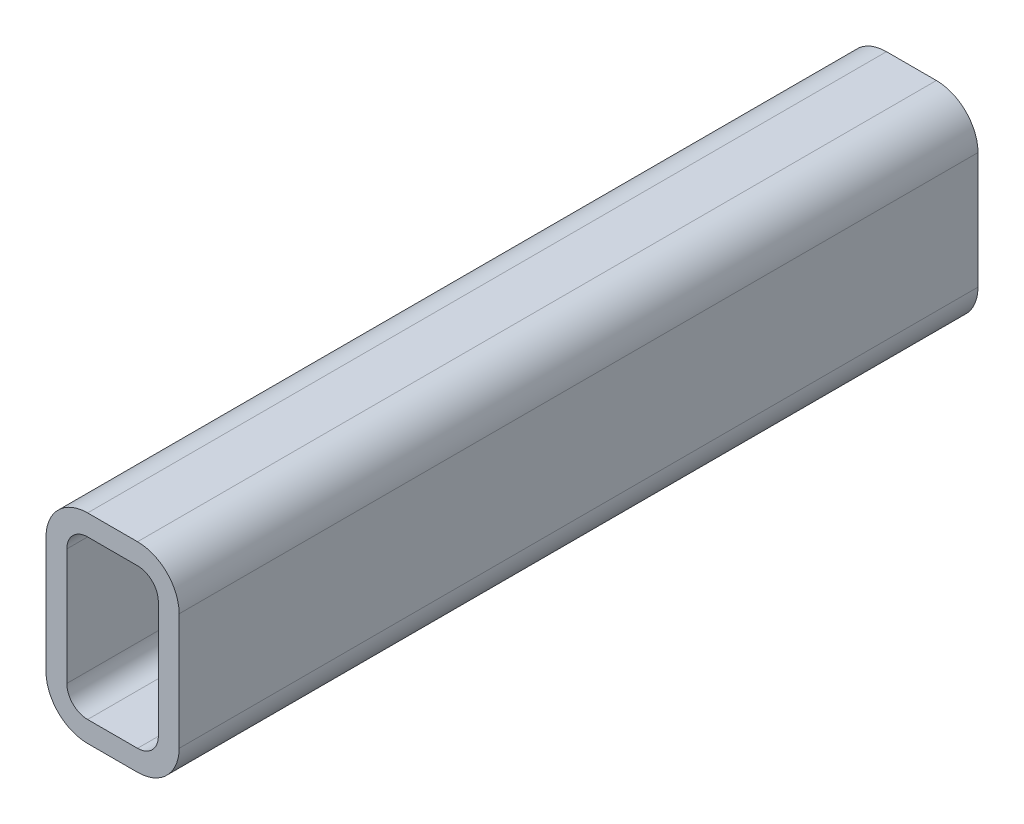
ISO-10303-21;
HEADER;
FILE_DESCRIPTION(('STEP AP214'),'2;1');
FILE_NAME('part.step','',(''),(''),'','','');
FILE_SCHEMA(('AUTOMOTIVE_DESIGN { 1 0 10303 214 1 1 1 1 }'));
ENDSEC;
DATA;
#1=APPLICATION_CONTEXT('core data for automotive mechanical design processes');
#2=APPLICATION_PROTOCOL_DEFINITION('international standard','automotive_design',2000,#1);
#3=PRODUCT_CONTEXT('',#1,'mechanical');
#4=PRODUCT('Part','Part','',(#3));
#5=PRODUCT_RELATED_PRODUCT_CATEGORY('part','',(#4));
#6=PRODUCT_DEFINITION_FORMATION('','',#4);
#7=PRODUCT_DEFINITION_CONTEXT('part definition',#1,'design');
#8=PRODUCT_DEFINITION('design','',#6,#7);
#9=PRODUCT_DEFINITION_SHAPE('','',#8);
#10=(LENGTH_UNIT() NAMED_UNIT(*) SI_UNIT(.MILLI.,.METRE.));
#11=(NAMED_UNIT(*) PLANE_ANGLE_UNIT() SI_UNIT($,.RADIAN.));
#12=(NAMED_UNIT(*) SI_UNIT($,.STERADIAN.) SOLID_ANGLE_UNIT());
#13=UNCERTAINTY_MEASURE_WITH_UNIT(LENGTH_MEASURE(1.E-05),#10,'distance_accuracy_value','');
#14=(GEOMETRIC_REPRESENTATION_CONTEXT(3) GLOBAL_UNCERTAINTY_ASSIGNED_CONTEXT((#13)) GLOBAL_UNIT_ASSIGNED_CONTEXT((#10,
#11,#12)) REPRESENTATION_CONTEXT('',''));
#15=CARTESIAN_POINT('',(0.,0.,0.));
#16=DIRECTION('',(0.,0.,1.));
#17=DIRECTION('',(1.,0.,0.));
#18=AXIS2_PLACEMENT_3D('',#15,#16,#17);
#19=CARTESIAN_POINT('',(15.875,60.325,304.8));
#20=DIRECTION('',(0.,0.,1.));
#21=DIRECTION('',(1.,0.,0.));
#22=AXIS2_PLACEMENT_3D('',#19,#20,#21);
#23=PLANE('',#22);
#24=CARTESIAN_POINT('',(15.875,60.325,304.8));
#25=DIRECTION('',(0.,0.,1.));
#26=DIRECTION('',(1.,0.,0.));
#27=AXIS2_PLACEMENT_3D('',#24,#25,#26);
#28=CIRCLE('',#27,15.875);
#29=CARTESIAN_POINT('',(15.875,76.2,304.8));
#30=VERTEX_POINT('',#29);
#31=CARTESIAN_POINT('',(0.,60.325,304.8));
#32=VERTEX_POINT('',#31);
#33=EDGE_CURVE('E211',#30,#32,#28,.T.);
#34=ORIENTED_EDGE('',*,*,#33,.T.);
#35=DIRECTION('',(0.,-1.,0.));
#36=VECTOR('',#35,1.);
#37=CARTESIAN_POINT('',(0.,15.875,304.8));
#38=LINE('',#37,#36);
#39=CARTESIAN_POINT('',(0.,15.875,304.8));
#40=VERTEX_POINT('',#39);
#41=EDGE_CURVE('E214',#32,#40,#38,.T.);
#42=ORIENTED_EDGE('',*,*,#41,.T.);
#43=CARTESIAN_POINT('',(15.875,15.875,304.8));
#44=DIRECTION('',(0.,0.,1.));
#45=DIRECTION('',(1.,0.,0.));
#46=AXIS2_PLACEMENT_3D('',#43,#44,#45);
#47=CIRCLE('',#46,15.875);
#48=CARTESIAN_POINT('',(15.875,0.,304.8));
#49=VERTEX_POINT('',#48);
#50=EDGE_CURVE('E217',#40,#49,#47,.T.);
#51=ORIENTED_EDGE('',*,*,#50,.T.);
#52=DIRECTION('',(1.,0.,0.));
#53=VECTOR('',#52,1.);
#54=CARTESIAN_POINT('',(34.925,0.,304.8));
#55=LINE('',#54,#53);
#56=CARTESIAN_POINT('',(34.925,0.,304.8));
#57=VERTEX_POINT('',#56);
#58=EDGE_CURVE('E219',#49,#57,#55,.T.);
#59=ORIENTED_EDGE('',*,*,#58,.T.);
#60=CARTESIAN_POINT('',(34.925,15.875,304.8));
#61=DIRECTION('',(0.,0.,1.));
#62=DIRECTION('',(1.,0.,0.));
#63=AXIS2_PLACEMENT_3D('',#60,#61,#62);
#64=CIRCLE('',#63,15.875);
#65=CARTESIAN_POINT('',(50.8,15.875,304.8));
#66=VERTEX_POINT('',#65);
#67=EDGE_CURVE('E221',#57,#66,#64,.T.);
#68=ORIENTED_EDGE('',*,*,#67,.T.);
#69=DIRECTION('',(0.,1.,0.));
#70=VECTOR('',#69,1.);
#71=CARTESIAN_POINT('',(50.8,60.325,304.8));
#72=LINE('',#71,#70);
#73=CARTESIAN_POINT('',(50.8,60.325,304.8));
#74=VERTEX_POINT('',#73);
#75=EDGE_CURVE('E223',#66,#74,#72,.T.);
#76=ORIENTED_EDGE('',*,*,#75,.T.);
#77=CARTESIAN_POINT('',(34.925,60.325,304.8));
#78=DIRECTION('',(0.,0.,1.));
#79=DIRECTION('',(1.,0.,0.));
#80=AXIS2_PLACEMENT_3D('',#77,#78,#79);
#81=CIRCLE('',#80,15.875);
#82=CARTESIAN_POINT('',(34.925,76.2,304.8));
#83=VERTEX_POINT('',#82);
#84=EDGE_CURVE('E225',#74,#83,#81,.T.);
#85=ORIENTED_EDGE('',*,*,#84,.T.);
#86=DIRECTION('',(-1.,0.,0.));
#87=VECTOR('',#86,1.);
#88=CARTESIAN_POINT('',(15.875,76.2,304.8));
#89=LINE('',#88,#87);
#90=EDGE_CURVE('E227',#83,#30,#89,.T.);
#91=ORIENTED_EDGE('',*,*,#90,.T.);
#92=EDGE_LOOP('',(#34,#42,#51,#59,#68,#76,#85,#91));
#93=FACE_BOUND('',#92,.T.);
#94=DIRECTION('',(0.,-1.,0.));
#95=VECTOR('',#94,1.);
#96=CARTESIAN_POINT('',(7.9375,15.875,304.8));
#97=LINE('',#96,#95);
#98=CARTESIAN_POINT('',(7.9375,60.325,304.8));
#99=VERTEX_POINT('',#98);
#100=CARTESIAN_POINT('',(7.9375,15.875,304.8));
#101=VERTEX_POINT('',#100);
#102=EDGE_CURVE('E154',#99,#101,#97,.T.);
#103=ORIENTED_EDGE('',*,*,#102,.F.);
#104=CARTESIAN_POINT('',(15.875,60.325,304.8));
#105=DIRECTION('',(0.,0.,1.));
#106=DIRECTION('',(1.,0.,0.));
#107=AXIS2_PLACEMENT_3D('',#104,#105,#106);
#108=CIRCLE('',#107,7.93750000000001);
#109=CARTESIAN_POINT('',(15.875,68.2625,304.8));
#110=VERTEX_POINT('',#109);
#111=EDGE_CURVE('E146',#110,#99,#108,.T.);
#112=ORIENTED_EDGE('',*,*,#111,.F.);
#113=DIRECTION('',(-1.,0.,0.));
#114=VECTOR('',#113,1.);
#115=CARTESIAN_POINT('',(15.875,68.2625,304.8));
#116=LINE('',#115,#114);
#117=CARTESIAN_POINT('',(34.925,68.2625,304.8));
#118=VERTEX_POINT('',#117);
#119=EDGE_CURVE('E179',#118,#110,#116,.T.);
#120=ORIENTED_EDGE('',*,*,#119,.F.);
#121=CARTESIAN_POINT('',(34.925,60.325,304.8));
#122=DIRECTION('',(0.,0.,1.));
#123=DIRECTION('',(1.,0.,0.));
#124=AXIS2_PLACEMENT_3D('',#121,#122,#123);
#125=CIRCLE('',#124,7.93750000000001);
#126=CARTESIAN_POINT('',(42.8625,60.325,304.8));
#127=VERTEX_POINT('',#126);
#128=EDGE_CURVE('E177',#127,#118,#125,.T.);
#129=ORIENTED_EDGE('',*,*,#128,.F.);
#130=DIRECTION('',(0.,1.,0.));
#131=VECTOR('',#130,1.);
#132=CARTESIAN_POINT('',(42.8625,60.325,304.8));
#133=LINE('',#132,#131);
#134=CARTESIAN_POINT('',(42.8625,15.875,304.8));
#135=VERTEX_POINT('',#134);
#136=EDGE_CURVE('E175',#135,#127,#133,.T.);
#137=ORIENTED_EDGE('',*,*,#136,.F.);
#138=CARTESIAN_POINT('',(34.925,15.875,304.8));
#139=DIRECTION('',(0.,0.,1.));
#140=DIRECTION('',(1.,0.,0.));
#141=AXIS2_PLACEMENT_3D('',#138,#139,#140);
#142=CIRCLE('',#141,7.9375);
#143=CARTESIAN_POINT('',(34.925,7.93750000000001,304.8));
#144=VERTEX_POINT('',#143);
#145=EDGE_CURVE('E173',#144,#135,#142,.T.);
#146=ORIENTED_EDGE('',*,*,#145,.F.);
#147=DIRECTION('',(1.,0.,0.));
#148=VECTOR('',#147,1.);
#149=CARTESIAN_POINT('',(34.925,7.93750000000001,304.8));
#150=LINE('',#149,#148);
#151=CARTESIAN_POINT('',(15.875,7.93750000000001,304.8));
#152=VERTEX_POINT('',#151);
#153=EDGE_CURVE('E169',#152,#144,#150,.T.);
#154=ORIENTED_EDGE('',*,*,#153,.F.);
#155=CARTESIAN_POINT('',(15.875,15.875,304.8));
#156=DIRECTION('',(0.,0.,1.));
#157=DIRECTION('',(1.,0.,0.));
#158=AXIS2_PLACEMENT_3D('',#155,#156,#157);
#159=CIRCLE('',#158,7.9375);
#160=EDGE_CURVE('E167',#101,#152,#159,.T.);
#161=ORIENTED_EDGE('',*,*,#160,.F.);
#162=EDGE_LOOP('',(#103,#112,#120,#129,#137,#146,#154,#161));
#163=FACE_BOUND('',#162,.T.);
#164=ADVANCED_FACE('F33',(#93,#163),#23,.T.);
#165=CARTESIAN_POINT('',(15.875,60.325,0.));
#166=DIRECTION('',(0.,0.,1.));
#167=DIRECTION('',(1.,0.,0.));
#168=AXIS2_PLACEMENT_3D('',#165,#166,#167);
#169=PLANE('',#168);
#170=CARTESIAN_POINT('',(15.875,60.325,0.));
#171=DIRECTION('',(0.,0.,1.));
#172=DIRECTION('',(1.,0.,0.));
#173=AXIS2_PLACEMENT_3D('',#170,#171,#172);
#174=CIRCLE('',#173,15.875);
#175=CARTESIAN_POINT('',(15.875,76.2,0.));
#176=VERTEX_POINT('',#175);
#177=CARTESIAN_POINT('',(0.,60.325,0.));
#178=VERTEX_POINT('',#177);
#179=EDGE_CURVE('E162',#176,#178,#174,.T.);
#180=ORIENTED_EDGE('',*,*,#179,.F.);
#181=DIRECTION('',(-1.,0.,0.));
#182=VECTOR('',#181,1.);
#183=CARTESIAN_POINT('',(15.875,76.2,0.));
#184=LINE('',#183,#182);
#185=CARTESIAN_POINT('',(34.925,76.2,0.));
#186=VERTEX_POINT('',#185);
#187=EDGE_CURVE('E215',#186,#176,#184,.T.);
#188=ORIENTED_EDGE('',*,*,#187,.F.);
#189=CARTESIAN_POINT('',(34.925,60.325,0.));
#190=DIRECTION('',(0.,0.,1.));
#191=DIRECTION('',(1.,0.,0.));
#192=AXIS2_PLACEMENT_3D('',#189,#190,#191);
#193=CIRCLE('',#192,15.875);
#194=CARTESIAN_POINT('',(50.8,60.325,0.));
#195=VERTEX_POINT('',#194);
#196=EDGE_CURVE('E242',#195,#186,#193,.T.);
#197=ORIENTED_EDGE('',*,*,#196,.F.);
#198=DIRECTION('',(0.,1.,0.));
#199=VECTOR('',#198,1.);
#200=CARTESIAN_POINT('',(50.8,60.325,0.));
#201=LINE('',#200,#199);
#202=CARTESIAN_POINT('',(50.8,15.875,0.));
#203=VERTEX_POINT('',#202);
#204=EDGE_CURVE('E240',#203,#195,#201,.T.);
#205=ORIENTED_EDGE('',*,*,#204,.F.);
#206=CARTESIAN_POINT('',(34.925,15.875,0.));
#207=DIRECTION('',(0.,0.,1.));
#208=DIRECTION('',(1.,0.,0.));
#209=AXIS2_PLACEMENT_3D('',#206,#207,#208);
#210=CIRCLE('',#209,15.875);
#211=CARTESIAN_POINT('',(34.925,0.,0.));
#212=VERTEX_POINT('',#211);
#213=EDGE_CURVE('E238',#212,#203,#210,.T.);
#214=ORIENTED_EDGE('',*,*,#213,.F.);
#215=DIRECTION('',(1.,0.,0.));
#216=VECTOR('',#215,1.);
#217=CARTESIAN_POINT('',(34.925,0.,0.));
#218=LINE('',#217,#216);
#219=CARTESIAN_POINT('',(15.875,0.,0.));
#220=VERTEX_POINT('',#219);
#221=EDGE_CURVE('E236',#220,#212,#218,.T.);
#222=ORIENTED_EDGE('',*,*,#221,.F.);
#223=CARTESIAN_POINT('',(15.875,15.875,0.));
#224=DIRECTION('',(0.,0.,1.));
#225=DIRECTION('',(1.,0.,0.));
#226=AXIS2_PLACEMENT_3D('',#223,#224,#225);
#227=CIRCLE('',#226,15.875);
#228=CARTESIAN_POINT('',(0.,15.875,0.));
#229=VERTEX_POINT('',#228);
#230=EDGE_CURVE('E234',#229,#220,#227,.T.);
#231=ORIENTED_EDGE('',*,*,#230,.F.);
#232=DIRECTION('',(0.,-1.,0.));
#233=VECTOR('',#232,1.);
#234=CARTESIAN_POINT('',(0.,15.875,0.));
#235=LINE('',#234,#233);
#236=EDGE_CURVE('E232',#178,#229,#235,.T.);
#237=ORIENTED_EDGE('',*,*,#236,.F.);
#238=EDGE_LOOP('',(#180,#188,#197,#205,#214,#222,#231,#237));
#239=FACE_BOUND('',#238,.T.);
#240=CARTESIAN_POINT('',(15.875,60.325,0.));
#241=DIRECTION('',(0.,0.,1.));
#242=DIRECTION('',(1.,0.,0.));
#243=AXIS2_PLACEMENT_3D('',#240,#241,#242);
#244=CIRCLE('',#243,7.93750000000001);
#245=CARTESIAN_POINT('',(15.875,68.2625,0.));
#246=VERTEX_POINT('',#245);
#247=CARTESIAN_POINT('',(7.9375,60.325,0.));
#248=VERTEX_POINT('',#247);
#249=EDGE_CURVE('E56',#246,#248,#244,.T.);
#250=ORIENTED_EDGE('',*,*,#249,.T.);
#251=DIRECTION('',(0.,-1.,0.));
#252=VECTOR('',#251,1.);
#253=CARTESIAN_POINT('',(7.9375,15.875,0.));
#254=LINE('',#253,#252);
#255=CARTESIAN_POINT('',(7.9375,15.875,0.));
#256=VERTEX_POINT('',#255);
#257=EDGE_CURVE('E161',#248,#256,#254,.T.);
#258=ORIENTED_EDGE('',*,*,#257,.T.);
#259=CARTESIAN_POINT('',(15.875,15.875,0.));
#260=DIRECTION('',(0.,0.,1.));
#261=DIRECTION('',(1.,0.,0.));
#262=AXIS2_PLACEMENT_3D('',#259,#260,#261);
#263=CIRCLE('',#262,7.9375);
#264=CARTESIAN_POINT('',(15.875,7.93750000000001,0.));
#265=VERTEX_POINT('',#264);
#266=EDGE_CURVE('E183',#256,#265,#263,.T.);
#267=ORIENTED_EDGE('',*,*,#266,.T.);
#268=DIRECTION('',(1.,0.,0.));
#269=VECTOR('',#268,1.);
#270=CARTESIAN_POINT('',(34.925,7.93750000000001,0.));
#271=LINE('',#270,#269);
#272=CARTESIAN_POINT('',(34.925,7.93750000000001,0.));
#273=VERTEX_POINT('',#272);
#274=EDGE_CURVE('E186',#265,#273,#271,.T.);
#275=ORIENTED_EDGE('',*,*,#274,.T.);
#276=CARTESIAN_POINT('',(34.925,15.875,0.));
#277=DIRECTION('',(0.,0.,1.));
#278=DIRECTION('',(1.,0.,0.));
#279=AXIS2_PLACEMENT_3D('',#276,#277,#278);
#280=CIRCLE('',#279,7.9375);
#281=CARTESIAN_POINT('',(42.8625,15.875,0.));
#282=VERTEX_POINT('',#281);
#283=EDGE_CURVE('E189',#273,#282,#280,.T.);
#284=ORIENTED_EDGE('',*,*,#283,.T.);
#285=DIRECTION('',(0.,1.,0.));
#286=VECTOR('',#285,1.);
#287=CARTESIAN_POINT('',(42.8625,60.325,0.));
#288=LINE('',#287,#286);
#289=CARTESIAN_POINT('',(42.8625,60.325,0.));
#290=VERTEX_POINT('',#289);
#291=EDGE_CURVE('E192',#282,#290,#288,.T.);
#292=ORIENTED_EDGE('',*,*,#291,.T.);
#293=CARTESIAN_POINT('',(34.925,60.325,0.));
#294=DIRECTION('',(0.,0.,1.));
#295=DIRECTION('',(1.,0.,0.));
#296=AXIS2_PLACEMENT_3D('',#293,#294,#295);
#297=CIRCLE('',#296,7.93750000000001);
#298=CARTESIAN_POINT('',(34.925,68.2625,0.));
#299=VERTEX_POINT('',#298);
#300=EDGE_CURVE('E195',#290,#299,#297,.T.);
#301=ORIENTED_EDGE('',*,*,#300,.T.);
#302=DIRECTION('',(-1.,0.,0.));
#303=VECTOR('',#302,1.);
#304=CARTESIAN_POINT('',(15.875,68.2625,0.));
#305=LINE('',#304,#303);
#306=EDGE_CURVE('E155',#299,#246,#305,.T.);
#307=ORIENTED_EDGE('',*,*,#306,.T.);
#308=EDGE_LOOP('',(#250,#258,#267,#275,#284,#292,#301,#307));
#309=FACE_BOUND('',#308,.T.);
#310=ADVANCED_FACE('F272',(#239,#309),#169,.F.);
#311=CARTESIAN_POINT('',(15.875,60.325,304.8));
#312=DIRECTION('',(0.,0.,-1.));
#313=DIRECTION('',(-1.,0.,0.));
#314=AXIS2_PLACEMENT_3D('',#311,#312,#313);
#315=CYLINDRICAL_SURFACE('',#314,15.875);
#316=ORIENTED_EDGE('',*,*,#179,.T.);
#317=DIRECTION('',(0.,0.,-1.));
#318=VECTOR('',#317,1.);
#319=CARTESIAN_POINT('',(0.,60.325,304.8));
#320=LINE('',#319,#318);
#321=EDGE_CURVE('E11',#32,#178,#320,.T.);
#322=ORIENTED_EDGE('',*,*,#321,.F.);
#323=ORIENTED_EDGE('',*,*,#33,.F.);
#324=DIRECTION('',(0.,0.,-1.));
#325=VECTOR('',#324,1.);
#326=CARTESIAN_POINT('',(15.875,76.2,304.8));
#327=LINE('',#326,#325);
#328=EDGE_CURVE('E229',#30,#176,#327,.T.);
#329=ORIENTED_EDGE('',*,*,#328,.T.);
#330=EDGE_LOOP('',(#316,#322,#323,#329));
#331=FACE_BOUND('',#330,.T.);
#332=ADVANCED_FACE('F35',(#331),#315,.T.);
#333=CARTESIAN_POINT('',(0.,15.875,304.8));
#334=DIRECTION('',(1.,0.,0.));
#335=DIRECTION('',(0.,0.,-1.));
#336=AXIS2_PLACEMENT_3D('',#333,#334,#335);
#337=PLANE('',#336);
#338=ORIENTED_EDGE('',*,*,#236,.T.);
#339=DIRECTION('',(0.,0.,-1.));
#340=VECTOR('',#339,1.);
#341=CARTESIAN_POINT('',(0.,15.875,304.8));
#342=LINE('',#341,#340);
#343=EDGE_CURVE('E41',#40,#229,#342,.T.);
#344=ORIENTED_EDGE('',*,*,#343,.F.);
#345=ORIENTED_EDGE('',*,*,#41,.F.);
#346=ORIENTED_EDGE('',*,*,#321,.T.);
#347=EDGE_LOOP('',(#338,#344,#345,#346));
#348=FACE_BOUND('',#347,.T.);
#349=ADVANCED_FACE('F289',(#348),#337,.F.);
#350=CARTESIAN_POINT('',(15.875,15.875,304.8));
#351=DIRECTION('',(0.,0.,-1.));
#352=DIRECTION('',(-1.,0.,0.));
#353=AXIS2_PLACEMENT_3D('',#350,#351,#352);
#354=CYLINDRICAL_SURFACE('',#353,15.875);
#355=ORIENTED_EDGE('',*,*,#230,.T.);
#356=DIRECTION('',(0.,0.,-1.));
#357=VECTOR('',#356,1.);
#358=CARTESIAN_POINT('',(15.875,0.,304.8));
#359=LINE('',#358,#357);
#360=EDGE_CURVE('E259',#49,#220,#359,.T.);
#361=ORIENTED_EDGE('',*,*,#360,.F.);
#362=ORIENTED_EDGE('',*,*,#50,.F.);
#363=ORIENTED_EDGE('',*,*,#343,.T.);
#364=EDGE_LOOP('',(#355,#361,#362,#363));
#365=FACE_BOUND('',#364,.T.);
#366=ADVANCED_FACE('F266',(#365),#354,.T.);
#367=CARTESIAN_POINT('',(34.925,0.,304.8));
#368=DIRECTION('',(0.,1.,0.));
#369=DIRECTION('',(0.,0.,1.));
#370=AXIS2_PLACEMENT_3D('',#367,#368,#369);
#371=PLANE('',#370);
#372=ORIENTED_EDGE('',*,*,#221,.T.);
#373=DIRECTION('',(0.,0.,-1.));
#374=VECTOR('',#373,1.);
#375=CARTESIAN_POINT('',(34.925,0.,304.8));
#376=LINE('',#375,#374);
#377=EDGE_CURVE('E256',#57,#212,#376,.T.);
#378=ORIENTED_EDGE('',*,*,#377,.F.);
#379=ORIENTED_EDGE('',*,*,#58,.F.);
#380=ORIENTED_EDGE('',*,*,#360,.T.);
#381=EDGE_LOOP('',(#372,#378,#379,#380));
#382=FACE_BOUND('',#381,.T.);
#383=ADVANCED_FACE('F278',(#382),#371,.F.);
#384=CARTESIAN_POINT('',(34.925,15.875,304.8));
#385=DIRECTION('',(0.,0.,-1.));
#386=DIRECTION('',(-1.,0.,0.));
#387=AXIS2_PLACEMENT_3D('',#384,#385,#386);
#388=CYLINDRICAL_SURFACE('',#387,15.875);
#389=ORIENTED_EDGE('',*,*,#213,.T.);
#390=DIRECTION('',(0.,0.,-1.));
#391=VECTOR('',#390,1.);
#392=CARTESIAN_POINT('',(50.8,15.875,304.8));
#393=LINE('',#392,#391);
#394=EDGE_CURVE('E253',#66,#203,#393,.T.);
#395=ORIENTED_EDGE('',*,*,#394,.F.);
#396=ORIENTED_EDGE('',*,*,#67,.F.);
#397=ORIENTED_EDGE('',*,*,#377,.T.);
#398=EDGE_LOOP('',(#389,#395,#396,#397));
#399=FACE_BOUND('',#398,.T.);
#400=ADVANCED_FACE('F282',(#399),#388,.T.);
#401=CARTESIAN_POINT('',(50.8,60.325,304.8));
#402=DIRECTION('',(-1.,0.,0.));
#403=DIRECTION('',(0.,0.,1.));
#404=AXIS2_PLACEMENT_3D('',#401,#402,#403);
#405=PLANE('',#404);
#406=ORIENTED_EDGE('',*,*,#204,.T.);
#407=DIRECTION('',(0.,0.,-1.));
#408=VECTOR('',#407,1.);
#409=CARTESIAN_POINT('',(50.8,60.325,304.8));
#410=LINE('',#409,#408);
#411=EDGE_CURVE('E250',#74,#195,#410,.T.);
#412=ORIENTED_EDGE('',*,*,#411,.F.);
#413=ORIENTED_EDGE('',*,*,#75,.F.);
#414=ORIENTED_EDGE('',*,*,#394,.T.);
#415=EDGE_LOOP('',(#406,#412,#413,#414));
#416=FACE_BOUND('',#415,.T.);
#417=ADVANCED_FACE('F302',(#416),#405,.F.);
#418=CARTESIAN_POINT('',(34.925,60.325,304.8));
#419=DIRECTION('',(0.,0.,-1.));
#420=DIRECTION('',(-1.,0.,0.));
#421=AXIS2_PLACEMENT_3D('',#418,#419,#420);
#422=CYLINDRICAL_SURFACE('',#421,15.875);
#423=ORIENTED_EDGE('',*,*,#196,.T.);
#424=DIRECTION('',(0.,0.,-1.));
#425=VECTOR('',#424,1.);
#426=CARTESIAN_POINT('',(34.925,76.2,304.8));
#427=LINE('',#426,#425);
#428=EDGE_CURVE('E247',#83,#186,#427,.T.);
#429=ORIENTED_EDGE('',*,*,#428,.F.);
#430=ORIENTED_EDGE('',*,*,#84,.F.);
#431=ORIENTED_EDGE('',*,*,#411,.T.);
#432=EDGE_LOOP('',(#423,#429,#430,#431));
#433=FACE_BOUND('',#432,.T.);
#434=ADVANCED_FACE('F300',(#433),#422,.T.);
#435=CARTESIAN_POINT('',(15.875,76.2,304.8));
#436=DIRECTION('',(0.,-1.,0.));
#437=DIRECTION('',(0.,0.,-1.));
#438=AXIS2_PLACEMENT_3D('',#435,#436,#437);
#439=PLANE('',#438);
#440=ORIENTED_EDGE('',*,*,#187,.T.);
#441=ORIENTED_EDGE('',*,*,#328,.F.);
#442=ORIENTED_EDGE('',*,*,#90,.F.);
#443=ORIENTED_EDGE('',*,*,#428,.T.);
#444=EDGE_LOOP('',(#440,#441,#442,#443));
#445=FACE_BOUND('',#444,.T.);
#446=ADVANCED_FACE('F295',(#445),#439,.F.);
#447=CARTESIAN_POINT('',(15.875,60.325,304.8));
#448=DIRECTION('',(0.,0.,-1.));
#449=DIRECTION('',(-1.,0.,0.));
#450=AXIS2_PLACEMENT_3D('',#447,#448,#449);
#451=CYLINDRICAL_SURFACE('',#450,7.93750000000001);
#452=ORIENTED_EDGE('',*,*,#249,.F.);
#453=DIRECTION('',(0.,0.,-1.));
#454=VECTOR('',#453,1.);
#455=CARTESIAN_POINT('',(15.875,68.2625,304.8));
#456=LINE('',#455,#454);
#457=EDGE_CURVE('E150',#110,#246,#456,.T.);
#458=ORIENTED_EDGE('',*,*,#457,.F.);
#459=ORIENTED_EDGE('',*,*,#111,.T.);
#460=DIRECTION('',(0.,0.,-1.));
#461=VECTOR('',#460,1.);
#462=CARTESIAN_POINT('',(7.9375,60.325,304.8));
#463=LINE('',#462,#461);
#464=EDGE_CURVE('E149',#99,#248,#463,.T.);
#465=ORIENTED_EDGE('',*,*,#464,.T.);
#466=EDGE_LOOP('',(#452,#458,#459,#465));
#467=FACE_BOUND('',#466,.T.);
#468=ADVANCED_FACE('F148',(#467),#451,.F.);
#469=CARTESIAN_POINT('',(7.9375,15.875,304.8));
#470=DIRECTION('',(1.,0.,0.));
#471=DIRECTION('',(0.,0.,-1.));
#472=AXIS2_PLACEMENT_3D('',#469,#470,#471);
#473=PLANE('',#472);
#474=ORIENTED_EDGE('',*,*,#257,.F.);
#475=ORIENTED_EDGE('',*,*,#464,.F.);
#476=ORIENTED_EDGE('',*,*,#102,.T.);
#477=DIRECTION('',(0.,0.,-1.));
#478=VECTOR('',#477,1.);
#479=CARTESIAN_POINT('',(7.9375,15.875,304.8));
#480=LINE('',#479,#478);
#481=EDGE_CURVE('E163',#101,#256,#480,.T.);
#482=ORIENTED_EDGE('',*,*,#481,.T.);
#483=EDGE_LOOP('',(#474,#475,#476,#482));
#484=FACE_BOUND('',#483,.T.);
#485=ADVANCED_FACE('F158',(#484),#473,.T.);
#486=CARTESIAN_POINT('',(15.875,15.875,304.8));
#487=DIRECTION('',(0.,0.,-1.));
#488=DIRECTION('',(-1.,0.,0.));
#489=AXIS2_PLACEMENT_3D('',#486,#487,#488);
#490=CYLINDRICAL_SURFACE('',#489,7.9375);
#491=ORIENTED_EDGE('',*,*,#266,.F.);
#492=ORIENTED_EDGE('',*,*,#481,.F.);
#493=ORIENTED_EDGE('',*,*,#160,.T.);
#494=DIRECTION('',(0.,0.,-1.));
#495=VECTOR('',#494,1.);
#496=CARTESIAN_POINT('',(15.875,7.93750000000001,304.8));
#497=LINE('',#496,#495);
#498=EDGE_CURVE('E208',#152,#265,#497,.T.);
#499=ORIENTED_EDGE('',*,*,#498,.T.);
#500=EDGE_LOOP('',(#491,#492,#493,#499));
#501=FACE_BOUND('',#500,.T.);
#502=ADVANCED_FACE('F327',(#501),#490,.F.);
#503=CARTESIAN_POINT('',(34.925,7.93750000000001,304.8));
#504=DIRECTION('',(0.,1.,0.));
#505=DIRECTION('',(0.,0.,1.));
#506=AXIS2_PLACEMENT_3D('',#503,#504,#505);
#507=PLANE('',#506);
#508=ORIENTED_EDGE('',*,*,#274,.F.);
#509=ORIENTED_EDGE('',*,*,#498,.F.);
#510=ORIENTED_EDGE('',*,*,#153,.T.);
#511=DIRECTION('',(0.,0.,-1.));
#512=VECTOR('',#511,1.);
#513=CARTESIAN_POINT('',(34.925,7.93750000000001,304.8));
#514=LINE('',#513,#512);
#515=EDGE_CURVE('E206',#144,#273,#514,.T.);
#516=ORIENTED_EDGE('',*,*,#515,.T.);
#517=EDGE_LOOP('',(#508,#509,#510,#516));
#518=FACE_BOUND('',#517,.T.);
#519=ADVANCED_FACE('F331',(#518),#507,.T.);
#520=CARTESIAN_POINT('',(34.925,15.875,304.8));
#521=DIRECTION('',(0.,0.,-1.));
#522=DIRECTION('',(-1.,0.,0.));
#523=AXIS2_PLACEMENT_3D('',#520,#521,#522);
#524=CYLINDRICAL_SURFACE('',#523,7.9375);
#525=ORIENTED_EDGE('',*,*,#283,.F.);
#526=ORIENTED_EDGE('',*,*,#515,.F.);
#527=ORIENTED_EDGE('',*,*,#145,.T.);
#528=DIRECTION('',(0.,0.,-1.));
#529=VECTOR('',#528,1.);
#530=CARTESIAN_POINT('',(42.8625,15.875,304.8));
#531=LINE('',#530,#529);
#532=EDGE_CURVE('E204',#135,#282,#531,.T.);
#533=ORIENTED_EDGE('',*,*,#532,.T.);
#534=EDGE_LOOP('',(#525,#526,#527,#533));
#535=FACE_BOUND('',#534,.T.);
#536=ADVANCED_FACE('F337',(#535),#524,.F.);
#537=CARTESIAN_POINT('',(42.8625,60.325,304.8));
#538=DIRECTION('',(-1.,0.,0.));
#539=DIRECTION('',(0.,0.,1.));
#540=AXIS2_PLACEMENT_3D('',#537,#538,#539);
#541=PLANE('',#540);
#542=ORIENTED_EDGE('',*,*,#291,.F.);
#543=ORIENTED_EDGE('',*,*,#532,.F.);
#544=ORIENTED_EDGE('',*,*,#136,.T.);
#545=DIRECTION('',(0.,0.,-1.));
#546=VECTOR('',#545,1.);
#547=CARTESIAN_POINT('',(42.8625,60.325,304.8));
#548=LINE('',#547,#546);
#549=EDGE_CURVE('E202',#127,#290,#548,.T.);
#550=ORIENTED_EDGE('',*,*,#549,.T.);
#551=EDGE_LOOP('',(#542,#543,#544,#550));
#552=FACE_BOUND('',#551,.T.);
#553=ADVANCED_FACE('F341',(#552),#541,.T.);
#554=CARTESIAN_POINT('',(34.925,60.325,304.8));
#555=DIRECTION('',(0.,0.,-1.));
#556=DIRECTION('',(-1.,0.,0.));
#557=AXIS2_PLACEMENT_3D('',#554,#555,#556);
#558=CYLINDRICAL_SURFACE('',#557,7.93750000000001);
#559=ORIENTED_EDGE('',*,*,#300,.F.);
#560=ORIENTED_EDGE('',*,*,#549,.F.);
#561=ORIENTED_EDGE('',*,*,#128,.T.);
#562=DIRECTION('',(0.,0.,-1.));
#563=VECTOR('',#562,1.);
#564=CARTESIAN_POINT('',(34.925,68.2625,304.8));
#565=LINE('',#564,#563);
#566=EDGE_CURVE('E48',#118,#299,#565,.T.);
#567=ORIENTED_EDGE('',*,*,#566,.T.);
#568=EDGE_LOOP('',(#559,#560,#561,#567));
#569=FACE_BOUND('',#568,.T.);
#570=ADVANCED_FACE('F345',(#569),#558,.F.);
#571=CARTESIAN_POINT('',(15.875,68.2625,304.8));
#572=DIRECTION('',(0.,-1.,0.));
#573=DIRECTION('',(0.,0.,-1.));
#574=AXIS2_PLACEMENT_3D('',#571,#572,#573);
#575=PLANE('',#574);
#576=ORIENTED_EDGE('',*,*,#306,.F.);
#577=ORIENTED_EDGE('',*,*,#566,.F.);
#578=ORIENTED_EDGE('',*,*,#119,.T.);
#579=ORIENTED_EDGE('',*,*,#457,.T.);
#580=EDGE_LOOP('',(#576,#577,#578,#579));
#581=FACE_BOUND('',#580,.T.);
#582=ADVANCED_FACE('F349',(#581),#575,.T.);
#583=CLOSED_SHELL('',(#164,#310,#332,#349,#366,#383,#400,#417,#434,#446,#468,#485,#502,#519,
#536,#553,#570,#582));
#584=MANIFOLD_SOLID_BREP('B2',#583);
#585=ADVANCED_BREP_SHAPE_REPRESENTATION('',(#18,#584),#14);
#586=SHAPE_DEFINITION_REPRESENTATION(#9,#585);
ENDSEC;
END-ISO-10303-21;
